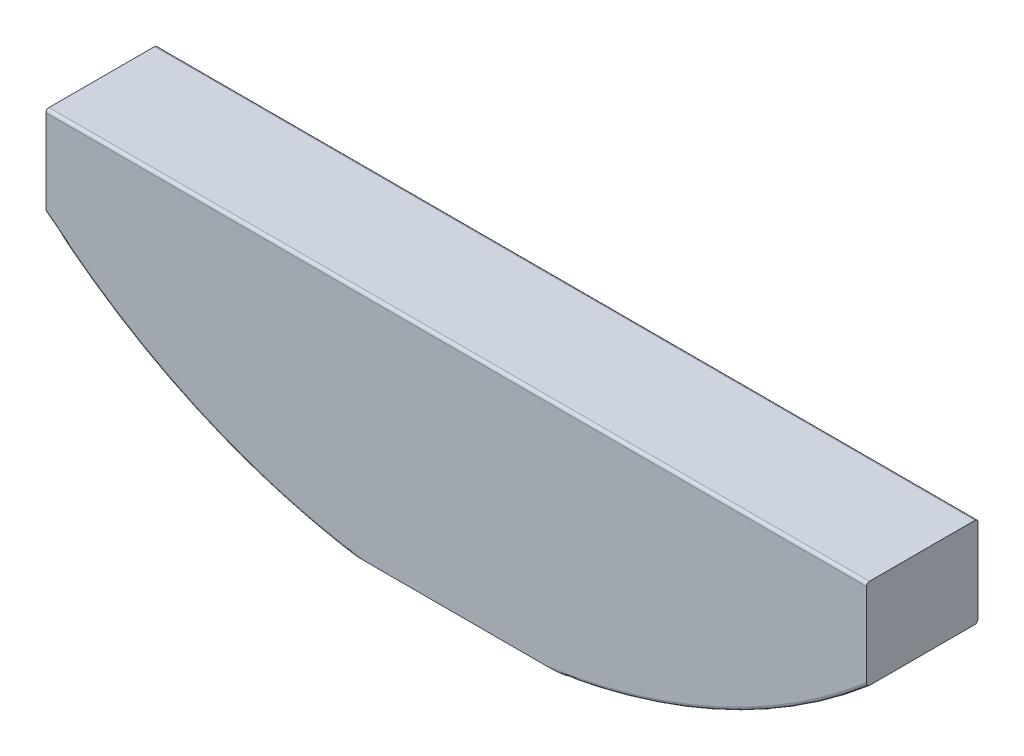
from build123d import *

# Parameters (mm, degrees)
EXTRUDE1_DEPTH          = 4.7625
FILLET3_R               = 0.127
CUT_EXTRUDE2_DEPTH      = 35.579418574
CUT_EXTRUDE2_DEPTH_BACK = 35.579418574
CUT_EXTRUDE1_DEPTH      = 35.258259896


with BuildPart() as part:
    # Sketch1 → Extrude1 (new body)
    with BuildSketch(Plane.XY):
        with BuildLine():
            Line((-21.224465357, -16.66875), (21.224465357, -16.66875))
            ThreePointArc((21.224465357, -16.66875), (0, -26.9875), (-21.224465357, -16.66875))
        make_face()
    extrude(amount=EXTRUDE1_DEPTH)

    # Fillet3
    fillet3_edges = [part.edges().sort_by_distance(p)[0] for p in [
        (0, -16.66875, 0),
        (0, -26.9875, 0),
        (0, -26.9875, 4.7625),
        (-21.224465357, -16.66875, 2.38125),
        (21.224465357, -16.66875, 2.38125),
        (0, -16.66875, 4.7625),
    ]]
    fillet(fillet3_edges, radius=FILLET3_R)

    # Sketch3 → Cut-Extrude2 (cut, two sides: drawn at the far end of the back side and taken through both)
    with BuildSketch(Plane.XY.offset(-CUT_EXTRUDE2_DEPTH_BACK)):
        Polygon((-205.935820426, -26.57475), (-50.8, -26.57475), (50.8, -26.57475), (205.935820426, -26.57475), (205.935820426, -336.846390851), (-205.935820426, -336.846390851), align=None)
    extrude(amount=CUT_EXTRUDE2_DEPTH + CUT_EXTRUDE2_DEPTH_BACK, mode=Mode.SUBTRACT)

    # Sketch2 → Cut-Extrude1 (cut, symmetric)
    with BuildSketch(Plane.XY):
        Polygon((-17.526, 113.073383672), (-17.526, 0), (-17.526, -50.8), (-17.526, -163.873383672), (-243.672767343, -163.873383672), (-243.672767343, 113.073383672), align=None)
    cut_extrude1 = extrude(amount=CUT_EXTRUDE1_DEPTH, both=True, mode=Mode.SUBTRACT)

    # Mirror1: Cut-Extrude1 across plane
    add(cut_extrude1.mirror(Plane(origin=(0, 0, 0), x_dir=(0, 0, 1), z_dir=(1, 0, 0))), mode=Mode.SUBTRACT)


solid = part.part
